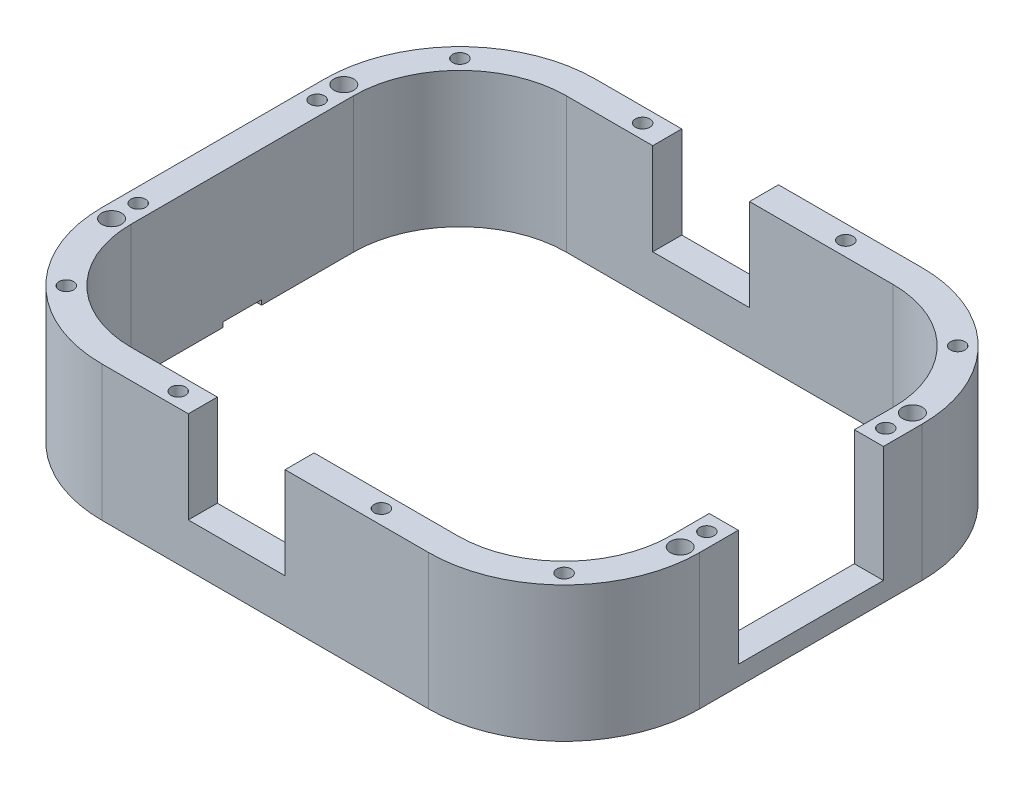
from build123d import *

# Parameters (mm, degrees)
SKETCH2_W           = 425.45
SKETCH2_H           = 336.55
BOSS_EXTRUDE1_DEPTH = 44.45
SKETCH3_OUTSIDE_W   = 537.392
SKETCH3_OUTSIDE_H   = 448.492
CUT_EXTRUDE1_DEPTH  = 305.376932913
CUT_EXTRUDE3_DEPTH  = 286.781502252
SKETCH5_W           = 63.5
SKETCH5_H           = 323.85
CUT_EXTRUDE4_DEPTH  = 60.325
CUT_EXTRUDE5_DEPTH  = 19.05
HOLE1_D             = 9.525
CUT_EXTRUDE6_DEPTH  = 3.175
HOLE2_D             = 13


with BuildPart() as part:
    # Sketch2 → Boss-Extrude1 (new, symmetric)
    with BuildSketch(Plane(origin=(0, 0, 0), x_dir=(1, 0, 0), z_dir=(0, 1, 0))):
        with Locations((24.8158, 0)):
            Rectangle(SKETCH2_W, SKETCH2_H)
    extrude(amount=BOSS_EXTRUDE1_DEPTH, both=True)

    # Sketch3 outside → Cut-Extrude1 (cut, through all)
    with BuildSketch(Plane(origin=(0, 44.45, 0), x_dir=(1, 0, 0), z_dir=(0, 1, 0))):
        with Locations((24.816, 0)):
            Rectangle(SKETCH3_OUTSIDE_W, SKETCH3_OUTSIDE_H)
        with BuildLine():
            Line((129.155386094, -161.925), (-85.284113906, -161.925))
            ThreePointArc((-85.284113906, -161.925), (-148.145906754, -135.886792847), (-174.184113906, -73.025))
            Line((-174.184113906, -73.025), (-174.184113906, 73.025))
            ThreePointArc((-174.184113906, 73.025), (-148.145906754, 135.886792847), (-85.284113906, 161.925))
            Line((-85.284113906, 161.925), (129.155386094, 161.925))
            ThreePointArc((129.155386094, 161.925), (192.017178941, 135.886792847), (218.055386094, 73.025))
            Line((218.055386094, 73.025), (218.055386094, -73.025))
            ThreePointArc((218.055386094, -73.025), (192.017178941, -135.886792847), (129.155386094, -161.925))
        make_face(mode=Mode.SUBTRACT)
    extrude(amount=-CUT_EXTRUDE1_DEPTH, mode=Mode.SUBTRACT)

    # Sketch4 → Cut-Extrude3 (cut, through all)
    with BuildSketch(Plane(origin=(0, 44.45, 0), x_dir=(1, 0, 0), z_dir=(0, 1, 0))):
        with BuildLine():
            Line((-85.284113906, -142.875), (129.155386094, -142.875))
            ThreePointArc((129.155386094, -142.875), (178.54679476, -122.416408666), (199.005386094, -73.025))
            Line((199.005386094, -73.025), (199.005386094, 73.025))
            ThreePointArc((199.005386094, 73.025), (178.54679476, 122.416408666), (129.155386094, 142.875))
            Line((129.155386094, 142.875), (-85.284113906, 142.875))
            ThreePointArc((-85.284113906, 142.875), (-134.675522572, 122.416408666), (-155.134113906, 73.025))
            Line((-155.134113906, 73.025), (-155.134113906, -73.025))
            ThreePointArc((-155.134113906, -73.025), (-134.675522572, -122.416408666), (-85.284113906, -142.875))
        make_face()
    extrude(amount=-CUT_EXTRUDE3_DEPTH, mode=Mode.SUBTRACT)

    # Sketch5 → Cut-Extrude4 (cut)
    with BuildSketch(Plane.XZ.offset(-44.45)):
        with Locations((3.175, 0)):
            Rectangle(SKETCH5_W, SKETCH5_H)
    extrude(amount=CUT_EXTRUDE4_DEPTH, mode=Mode.SUBTRACT)

    # Sketch6 → Cut-Extrude5 (cut)
    with BuildSketch(Plane(origin=(218.055386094, 0, 0), x_dir=(0, 0, -1), z_dir=(1, 0, 0))):
        with BuildLine():
            Line((47.625, 44.45), (47.625, -31.75))
            Line((47.625, -31.75), (-47.625, -31.75))
            Line((-47.625, -31.75), (-47.625, 44.45))
            ThreePointArc((-47.625, 44.45), (0, 92.075), (47.625, 44.45))
        make_face()
    extrude(amount=-CUT_EXTRUDE5_DEPTH, mode=Mode.SUBTRACT)

    # Hole1 (through all)
    with Locations(Plane(origin=(0, 44.45, 0), x_dir=(1, 0, 0), z_dir=(0, 1, 0))):
        with Locations((-44.739363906, -152.4), (-141.410714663, 129.151600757), (-164.659113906, 58.7375), (-141.410714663, -129.151600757), (-164.659113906, -58.7375), (88.610636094, -152.4), (185.281986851, -129.151600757), (208.530386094, -58.7375), (208.530386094, 58.7375), (185.281986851, 129.151600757), (88.610636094, 152.4), (-44.739363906, 152.4)):
            Hole(HOLE1_D / 2)

    # Sketch9 → Cut-Extrude6 (cut)
    with BuildSketch(Plane.XZ.offset(44.45)):
        with BuildLine():
            Line((-137.671613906, 12.7), (-156.721613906, 12.7))
            ThreePointArc((-156.721613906, 12.7), (-161.211741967, 10.840128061), (-163.071613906, 6.35))
            Line((-163.071613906, 6.35), (-163.071613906, -6.35))
            ThreePointArc((-163.071613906, -6.35), (-161.211741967, -10.840128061), (-156.721613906, -12.7))
            Line((-156.721613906, -12.7), (-137.671613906, -12.7))
            Line((-137.671613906, -12.7), (-137.671613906, 12.7))
        make_face()
    extrude(amount=-CUT_EXTRUDE6_DEPTH, mode=Mode.SUBTRACT)

    # Hole2 (through all)
    with Locations(Plane(origin=(0, 44.45, 0), x_dir=(1, 0, 0), z_dir=(0, 1, 0))):
        with Locations((-164.659113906, 76.2), (-164.659113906, -76.2), (208.530386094, -76.2), (208.530386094, 76.2)):
            Hole(HOLE2_D / 2)


solid = part.part
